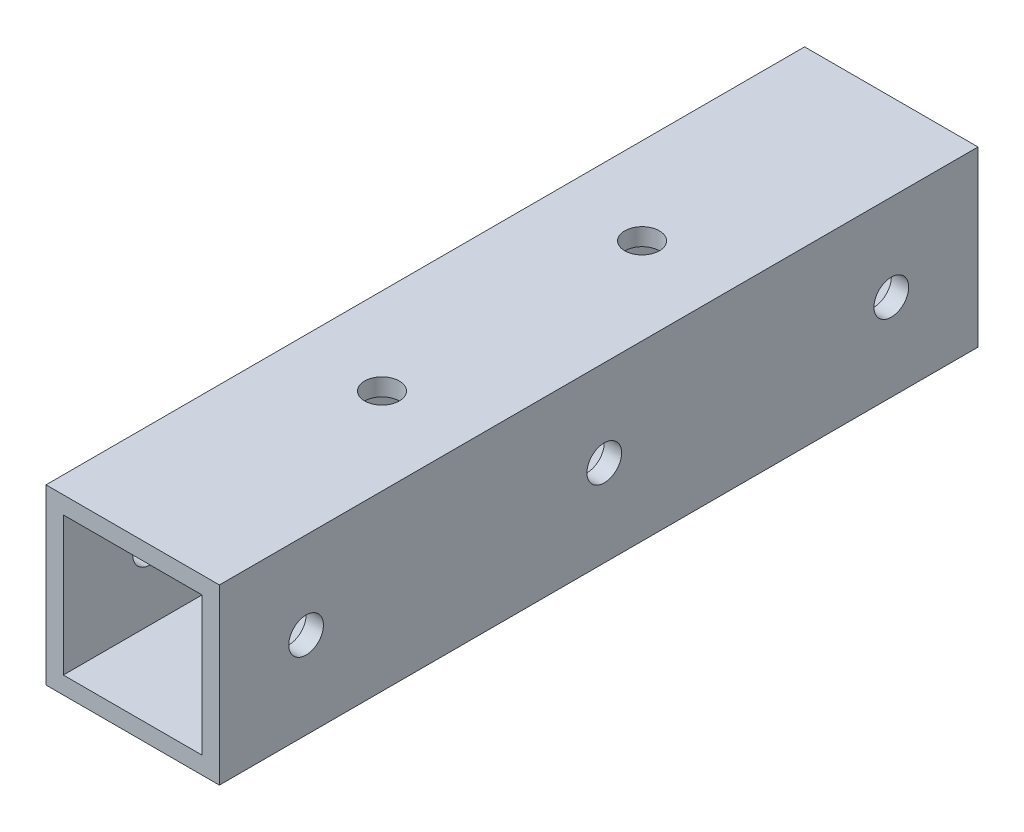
from build123d import *

# Parameters (mm, degrees)
SKETCH_1_W            = 20
SKETCH_1_H            = 20
SKETCH_1_W_2          = 16
SKETCH_1_H_2          = 16
EXTRUDE_1_DEPTH       = 87.5
HOLE_WIZARD_4_0_4_1_D = 4
HOLE_WIZARD_4_0_4_2_D = 4


with BuildPart() as part:
    # Sketch 1 → Extrude 1 (new body)
    with BuildSketch(Plane.XY):
        Rectangle(SKETCH_1_W, SKETCH_1_H)
        Rectangle(SKETCH_1_W_2, SKETCH_1_H_2, mode=Mode.SUBTRACT)
    extrude(amount=EXTRUDE_1_DEPTH)

    # Hole Wizard 4.0 _4_ _1 (through all)
    with Locations(Plane.ZY.offset(10)):
        with Locations((10, 0), (43.109052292, 0), (77.5, 0)):
            Hole(HOLE_WIZARD_4_0_4_1_D / 2)

    # Hole Wizard 4.0 _4_ _2 (through all)
    with Locations(Plane(origin=(0, 10, 0), x_dir=(1, 0, 0), z_dir=(0, 1, 0))):
        with Locations((0, -58.75), (0, -28.75)):
            Hole(HOLE_WIZARD_4_0_4_2_D / 2)


solid = part.part
